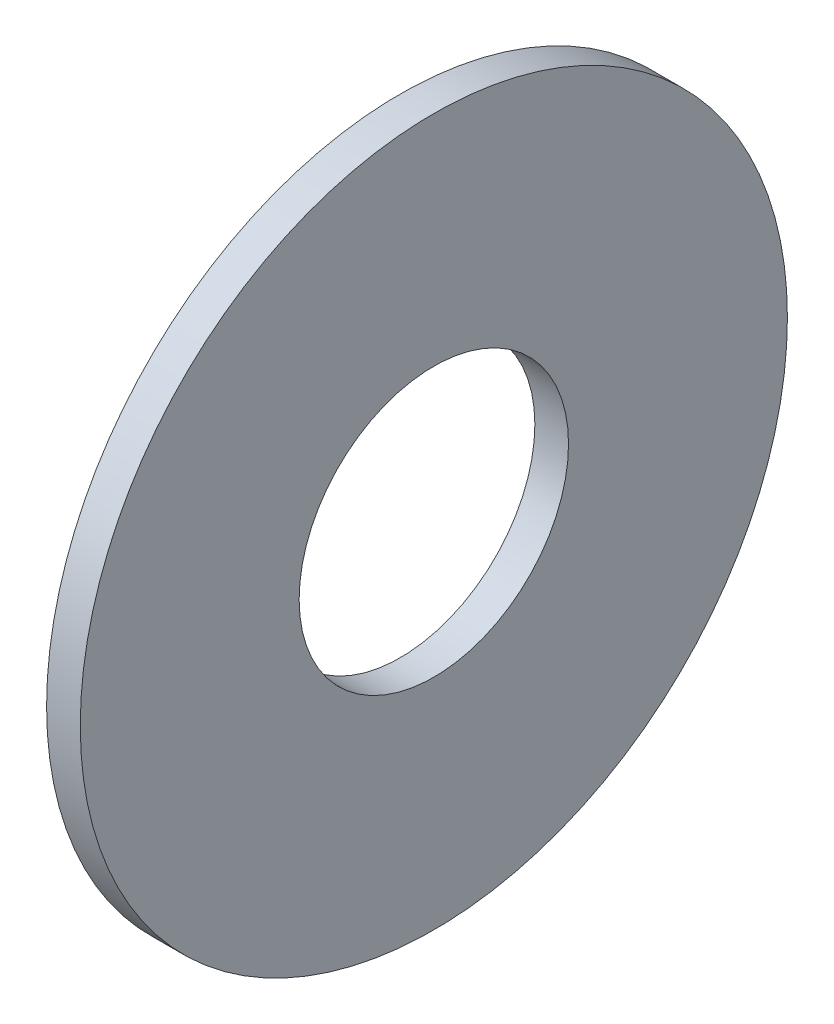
ISO-10303-21;
HEADER;
FILE_DESCRIPTION(('STEP AP214'),'2;1');
FILE_NAME('part.step','',(''),(''),'','','');
FILE_SCHEMA(('AUTOMOTIVE_DESIGN { 1 0 10303 214 1 1 1 1 }'));
ENDSEC;
DATA;
#1=APPLICATION_CONTEXT('core data for automotive mechanical design processes');
#2=APPLICATION_PROTOCOL_DEFINITION('international standard','automotive_design',2000,#1);
#3=PRODUCT_CONTEXT('',#1,'mechanical');
#4=PRODUCT('Part','Part','',(#3));
#5=PRODUCT_RELATED_PRODUCT_CATEGORY('part','',(#4));
#6=PRODUCT_DEFINITION_FORMATION('','',#4);
#7=PRODUCT_DEFINITION_CONTEXT('part definition',#1,'design');
#8=PRODUCT_DEFINITION('design','',#6,#7);
#9=PRODUCT_DEFINITION_SHAPE('','',#8);
#10=(LENGTH_UNIT() NAMED_UNIT(*) SI_UNIT(.MILLI.,.METRE.));
#11=(NAMED_UNIT(*) PLANE_ANGLE_UNIT() SI_UNIT($,.RADIAN.));
#12=(NAMED_UNIT(*) SI_UNIT($,.STERADIAN.) SOLID_ANGLE_UNIT());
#13=UNCERTAINTY_MEASURE_WITH_UNIT(LENGTH_MEASURE(1.E-05),#10,'distance_accuracy_value','');
#14=(GEOMETRIC_REPRESENTATION_CONTEXT(3) GLOBAL_UNCERTAINTY_ASSIGNED_CONTEXT((#13)) GLOBAL_UNIT_ASSIGNED_CONTEXT((#10,
#11,#12)) REPRESENTATION_CONTEXT('',''));
#15=CARTESIAN_POINT('',(0.,0.,0.));
#16=DIRECTION('',(0.,0.,1.));
#17=DIRECTION('',(1.,0.,0.));
#18=AXIS2_PLACEMENT_3D('',#15,#16,#17);
#19=CARTESIAN_POINT('',(1.,0.,0.));
#20=DIRECTION('',(1.,0.,0.));
#21=DIRECTION('',(0.,0.,-1.));
#22=AXIS2_PLACEMENT_3D('',#19,#20,#21);
#23=PLANE('',#22);
#24=CARTESIAN_POINT('',(1.,0.,0.));
#25=DIRECTION('',(1.,0.,0.));
#26=DIRECTION('',(0.,0.,-1.));
#27=AXIS2_PLACEMENT_3D('',#24,#25,#26);
#28=CIRCLE('',#27,10.5);
#29=CARTESIAN_POINT('',(1.,0.,-10.5));
#30=VERTEX_POINT('',#29);
#31=EDGE_CURVE('E10',#30,#30,#28,.T.);
#32=ORIENTED_EDGE('',*,*,#31,.T.);
#33=EDGE_LOOP('',(#32));
#34=FACE_BOUND('',#33,.T.);
#35=CARTESIAN_POINT('',(1.,0.,0.));
#36=DIRECTION('',(1.,0.,0.));
#37=DIRECTION('',(0.,0.,-1.));
#38=AXIS2_PLACEMENT_3D('',#35,#36,#37);
#39=CIRCLE('',#38,4.);
#40=CARTESIAN_POINT('',(1.,0.,-4.));
#41=VERTEX_POINT('',#40);
#42=EDGE_CURVE('E47',#41,#41,#39,.T.);
#43=ORIENTED_EDGE('',*,*,#42,.F.);
#44=EDGE_LOOP('',(#43));
#45=FACE_BOUND('',#44,.T.);
#46=ADVANCED_FACE('F36',(#34,#45),#23,.T.);
#47=CARTESIAN_POINT('',(0.,0.,0.));
#48=DIRECTION('',(1.,0.,0.));
#49=DIRECTION('',(0.,0.,-1.));
#50=AXIS2_PLACEMENT_3D('',#47,#48,#49);
#51=PLANE('',#50);
#52=CARTESIAN_POINT('',(0.,0.,0.));
#53=DIRECTION('',(1.,0.,0.));
#54=DIRECTION('',(0.,0.,-1.));
#55=AXIS2_PLACEMENT_3D('',#52,#53,#54);
#56=CIRCLE('',#55,10.5);
#57=CARTESIAN_POINT('',(0.,0.,-10.5));
#58=VERTEX_POINT('',#57);
#59=EDGE_CURVE('E40',#58,#58,#56,.T.);
#60=ORIENTED_EDGE('',*,*,#59,.F.);
#61=EDGE_LOOP('',(#60));
#62=FACE_BOUND('',#61,.T.);
#63=CARTESIAN_POINT('',(0.,0.,0.));
#64=DIRECTION('',(1.,0.,0.));
#65=DIRECTION('',(0.,0.,-1.));
#66=AXIS2_PLACEMENT_3D('',#63,#64,#65);
#67=CIRCLE('',#66,4.);
#68=CARTESIAN_POINT('',(0.,0.,-4.));
#69=VERTEX_POINT('',#68);
#70=EDGE_CURVE('E49',#69,#69,#67,.T.);
#71=ORIENTED_EDGE('',*,*,#70,.T.);
#72=EDGE_LOOP('',(#71));
#73=FACE_BOUND('',#72,.T.);
#74=ADVANCED_FACE('F59',(#62,#73),#51,.F.);
#75=CARTESIAN_POINT('',(1.,0.,0.));
#76=DIRECTION('',(-1.,0.,0.));
#77=DIRECTION('',(0.,0.,1.));
#78=AXIS2_PLACEMENT_3D('',#75,#76,#77);
#79=CYLINDRICAL_SURFACE('',#78,10.5);
#80=ORIENTED_EDGE('',*,*,#31,.F.);
#81=EDGE_LOOP('',(#80));
#82=FACE_BOUND('',#81,.T.);
#83=ORIENTED_EDGE('',*,*,#59,.T.);
#84=EDGE_LOOP('',(#83));
#85=FACE_BOUND('',#84,.T.);
#86=ADVANCED_FACE('F38',(#82,#85),#79,.T.);
#87=CARTESIAN_POINT('',(1.,0.,0.));
#88=DIRECTION('',(-1.,0.,0.));
#89=DIRECTION('',(0.,0.,1.));
#90=AXIS2_PLACEMENT_3D('',#87,#88,#89);
#91=CYLINDRICAL_SURFACE('',#90,4.);
#92=ORIENTED_EDGE('',*,*,#42,.T.);
#93=EDGE_LOOP('',(#92));
#94=FACE_BOUND('',#93,.T.);
#95=ORIENTED_EDGE('',*,*,#70,.F.);
#96=EDGE_LOOP('',(#95));
#97=FACE_BOUND('',#96,.T.);
#98=ADVANCED_FACE('F55',(#94,#97),#91,.F.);
#99=CLOSED_SHELL('',(#46,#74,#86,#98));
#100=MANIFOLD_SOLID_BREP('B2',#99);
#101=ADVANCED_BREP_SHAPE_REPRESENTATION('',(#18,#100),#14);
#102=SHAPE_DEFINITION_REPRESENTATION(#9,#101);
ENDSEC;
END-ISO-10303-21;
